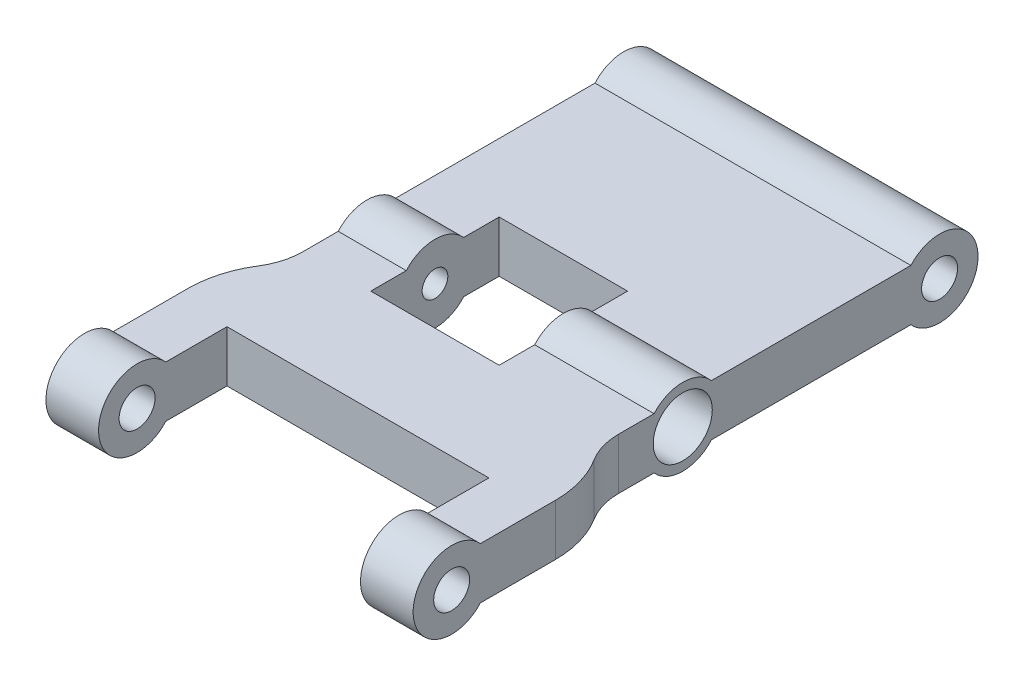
ISO-10303-21;
HEADER;
FILE_DESCRIPTION(('STEP AP214'),'2;1');
FILE_NAME('part.step','',(''),(''),'','','');
FILE_SCHEMA(('AUTOMOTIVE_DESIGN { 1 0 10303 214 1 1 1 1 }'));
ENDSEC;
DATA;
#1=APPLICATION_CONTEXT('core data for automotive mechanical design processes');
#2=APPLICATION_PROTOCOL_DEFINITION('international standard','automotive_design',2000,#1);
#3=PRODUCT_CONTEXT('',#1,'mechanical');
#4=PRODUCT('Part','Part','',(#3));
#5=PRODUCT_RELATED_PRODUCT_CATEGORY('part','',(#4));
#6=PRODUCT_DEFINITION_FORMATION('','',#4);
#7=PRODUCT_DEFINITION_CONTEXT('part definition',#1,'design');
#8=PRODUCT_DEFINITION('design','',#6,#7);
#9=PRODUCT_DEFINITION_SHAPE('','',#8);
#10=(LENGTH_UNIT() NAMED_UNIT(*) SI_UNIT(.MILLI.,.METRE.));
#11=(NAMED_UNIT(*) PLANE_ANGLE_UNIT() SI_UNIT($,.RADIAN.));
#12=(NAMED_UNIT(*) SI_UNIT($,.STERADIAN.) SOLID_ANGLE_UNIT());
#13=UNCERTAINTY_MEASURE_WITH_UNIT(LENGTH_MEASURE(1.E-05),#10,'distance_accuracy_value','');
#14=(GEOMETRIC_REPRESENTATION_CONTEXT(3) GLOBAL_UNCERTAINTY_ASSIGNED_CONTEXT((#13)) GLOBAL_UNIT_ASSIGNED_CONTEXT((#10,
#11,#12)) REPRESENTATION_CONTEXT('',''));
#15=CARTESIAN_POINT('',(0.,0.,0.));
#16=DIRECTION('',(0.,0.,1.));
#17=DIRECTION('',(1.,0.,0.));
#18=AXIS2_PLACEMENT_3D('',#15,#16,#17);
#19=CARTESIAN_POINT('',(0.,2.54,0.));
#20=DIRECTION('',(1.,0.,0.));
#21=DIRECTION('',(0.,0.,-1.));
#22=AXIS2_PLACEMENT_3D('',#19,#20,#21);
#23=CYLINDRICAL_SURFACE('',#22,3.81);
#24=CARTESIAN_POINT('',(28.575,2.54,0.));
#25=DIRECTION('',(1.,0.,0.));
#26=DIRECTION('',(0.,0.,-1.));
#27=AXIS2_PLACEMENT_3D('',#24,#25,#26);
#28=CIRCLE('',#27,3.81);
#29=CARTESIAN_POINT('',(28.575,0.,-2.83980633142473));
#30=VERTEX_POINT('',#29);
#31=CARTESIAN_POINT('',(28.575,5.08,-2.83980633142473));
#32=VERTEX_POINT('',#31);
#33=EDGE_CURVE('E52',#30,#32,#28,.F.);
#34=ORIENTED_EDGE('',*,*,#33,.F.);
#35=DIRECTION('',(1.,0.,0.));
#36=VECTOR('',#35,1.);
#37=CARTESIAN_POINT('',(0.,0.,-2.83980633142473));
#38=LINE('',#37,#36);
#39=CARTESIAN_POINT('',(33.782,0.,-2.83980633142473));
#40=VERTEX_POINT('',#39);
#41=EDGE_CURVE('E230',#40,#30,#38,.F.);
#42=ORIENTED_EDGE('',*,*,#41,.F.);
#43=CARTESIAN_POINT('',(33.782,2.54,0.));
#44=DIRECTION('',(1.,0.,0.));
#45=DIRECTION('',(0.,0.,-1.));
#46=AXIS2_PLACEMENT_3D('',#43,#44,#45);
#47=CIRCLE('',#46,3.81);
#48=CARTESIAN_POINT('',(33.782,5.08,-2.83980633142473));
#49=VERTEX_POINT('',#48);
#50=EDGE_CURVE('E252',#49,#40,#47,.T.);
#51=ORIENTED_EDGE('',*,*,#50,.F.);
#52=DIRECTION('',(1.,0.,0.));
#53=VECTOR('',#52,1.);
#54=CARTESIAN_POINT('',(0.,5.08,-2.83980633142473));
#55=LINE('',#54,#53);
#56=EDGE_CURVE('E374',#32,#49,#55,.T.);
#57=ORIENTED_EDGE('',*,*,#56,.F.);
#58=EDGE_LOOP('',(#34,#42,#51,#57));
#59=FACE_BOUND('',#58,.T.);
#60=ADVANCED_FACE('F35',(#59),#23,.T.);
#61=CARTESIAN_POINT('',(31.242,2.54,-25.4));
#62=DIRECTION('',(-1.,0.,0.));
#63=DIRECTION('',(0.,0.,1.));
#64=AXIS2_PLACEMENT_3D('',#61,#62,#63);
#65=CYLINDRICAL_SURFACE('',#64,1.27);
#66=CARTESIAN_POINT('',(6.731,2.54,-25.4));
#67=DIRECTION('',(-1.,0.,0.));
#68=DIRECTION('',(0.,0.,1.));
#69=AXIS2_PLACEMENT_3D('',#66,#67,#68);
#70=CIRCLE('',#69,1.27);
#71=CARTESIAN_POINT('',(6.731,2.54,-24.13));
#72=VERTEX_POINT('',#71);
#73=EDGE_CURVE('E318',#72,#72,#70,.F.);
#74=CARTESIAN_POINT('',(4.191,2.54,-25.4));
#75=DIRECTION('',(-1.,0.,0.));
#76=DIRECTION('',(0.,0.,1.));
#77=AXIS2_PLACEMENT_3D('',#74,#75,#76);
#78=CIRCLE('',#77,1.27);
#79=CARTESIAN_POINT('',(4.191,2.54,-24.13));
#80=VERTEX_POINT('',#79);
#81=EDGE_CURVE('E281',#80,#80,#78,.F.);
#82=CARTESIAN_POINT('',(6.731,2.54,-24.13));
#83=CARTESIAN_POINT('',(6.70454166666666,2.54,-24.13));
#84=CARTESIAN_POINT('',(6.67808333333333,2.54,-24.13));
#85=CARTESIAN_POINT('',(6.62516666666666,2.54,-24.13));
#86=CARTESIAN_POINT('',(6.59870833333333,2.54,-24.13));
#87=CARTESIAN_POINT('',(6.54579166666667,2.54,-24.13));
#88=CARTESIAN_POINT('',(6.51933333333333,2.54,-24.13));
#89=CARTESIAN_POINT('',(6.46641666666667,2.54,-24.13));
#90=CARTESIAN_POINT('',(6.43995833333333,2.54,-24.13));
#91=CARTESIAN_POINT('',(6.38704166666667,2.54,-24.13));
#92=CARTESIAN_POINT('',(6.36058333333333,2.54,-24.13));
#93=CARTESIAN_POINT('',(6.30766666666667,2.54,-24.13));
#94=CARTESIAN_POINT('',(6.28120833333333,2.54,-24.13));
#95=CARTESIAN_POINT('',(6.22829166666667,2.54,-24.13));
#96=CARTESIAN_POINT('',(6.20183333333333,2.54,-24.13));
#97=CARTESIAN_POINT('',(6.14891666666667,2.54,-24.13));
#98=CARTESIAN_POINT('',(6.12245833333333,2.54,-24.13));
#99=CARTESIAN_POINT('',(6.06954166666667,2.54,-24.13));
#100=CARTESIAN_POINT('',(6.04308333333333,2.54,-24.13));
#101=CARTESIAN_POINT('',(5.99016666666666,2.54,-24.13));
#102=CARTESIAN_POINT('',(5.96370833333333,2.54,-24.13));
#103=CARTESIAN_POINT('',(5.91079166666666,2.54,-24.13));
#104=CARTESIAN_POINT('',(5.88433333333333,2.54,-24.13));
#105=CARTESIAN_POINT('',(5.83141666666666,2.54,-24.13));
#106=CARTESIAN_POINT('',(5.80495833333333,2.54,-24.13));
#107=CARTESIAN_POINT('',(5.75204166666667,2.54,-24.13));
#108=CARTESIAN_POINT('',(5.72558333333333,2.54,-24.13));
#109=CARTESIAN_POINT('',(5.67266666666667,2.54,-24.13));
#110=CARTESIAN_POINT('',(5.64620833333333,2.54,-24.13));
#111=CARTESIAN_POINT('',(5.59329166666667,2.54,-24.13));
#112=CARTESIAN_POINT('',(5.56683333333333,2.54,-24.13));
#113=CARTESIAN_POINT('',(5.51391666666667,2.54,-24.13));
#114=CARTESIAN_POINT('',(5.48745833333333,2.54,-24.13));
#115=CARTESIAN_POINT('',(5.43454166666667,2.54,-24.13));
#116=CARTESIAN_POINT('',(5.40808333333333,2.54,-24.13));
#117=CARTESIAN_POINT('',(5.35516666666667,2.54,-24.13));
#118=CARTESIAN_POINT('',(5.32870833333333,2.54,-24.13));
#119=CARTESIAN_POINT('',(5.27579166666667,2.54,-24.13));
#120=CARTESIAN_POINT('',(5.24933333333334,2.54,-24.13));
#121=CARTESIAN_POINT('',(5.19641666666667,2.54,-24.13));
#122=CARTESIAN_POINT('',(5.16995833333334,2.54,-24.13));
#123=CARTESIAN_POINT('',(5.11704166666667,2.54,-24.13));
#124=CARTESIAN_POINT('',(5.09058333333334,2.54,-24.13));
#125=CARTESIAN_POINT('',(5.03766666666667,2.54,-24.13));
#126=CARTESIAN_POINT('',(5.01120833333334,2.54,-24.13));
#127=CARTESIAN_POINT('',(4.95829166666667,2.54,-24.13));
#128=CARTESIAN_POINT('',(4.93183333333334,2.54,-24.13));
#129=CARTESIAN_POINT('',(4.87891666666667,2.54,-24.13));
#130=CARTESIAN_POINT('',(4.85245833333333,2.54,-24.13));
#131=CARTESIAN_POINT('',(4.79954166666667,2.54,-24.13));
#132=CARTESIAN_POINT('',(4.77308333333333,2.54,-24.13));
#133=CARTESIAN_POINT('',(4.72016666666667,2.54,-24.13));
#134=CARTESIAN_POINT('',(4.69370833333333,2.54,-24.13));
#135=CARTESIAN_POINT('',(4.64079166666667,2.54,-24.13));
#136=CARTESIAN_POINT('',(4.61433333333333,2.54,-24.13));
#137=CARTESIAN_POINT('',(4.56141666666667,2.54,-24.13));
#138=CARTESIAN_POINT('',(4.53495833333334,2.54,-24.13));
#139=CARTESIAN_POINT('',(4.48204166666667,2.54,-24.13));
#140=CARTESIAN_POINT('',(4.45558333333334,2.54,-24.13));
#141=CARTESIAN_POINT('',(4.40266666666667,2.54,-24.13));
#142=CARTESIAN_POINT('',(4.37620833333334,2.54,-24.13));
#143=CARTESIAN_POINT('',(4.32329166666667,2.54,-24.13));
#144=CARTESIAN_POINT('',(4.29683333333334,2.54,-24.13));
#145=CARTESIAN_POINT('',(4.24391666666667,2.54,-24.13));
#146=CARTESIAN_POINT('',(4.21745833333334,2.54,-24.13));
#147=CARTESIAN_POINT('',(4.191,2.54,-24.13));
#148=B_SPLINE_CURVE_WITH_KNOTS('',3,(#82,#83,#84,#85,#86,#87,#88,#89,#90,#91,#92,#93,#94,#95,
#96,#97,#98,#99,#100,#101,#102,#103,#104,#105,#106,#107,#108,#109,#110,#111,#112,#113,#114,#115,
#116,#117,#118,#119,#120,#121,#122,#123,#124,#125,#126,#127,#128,#129,#130,#131,#132,#133,#134,
#135,#136,#137,#138,#139,#140,#141,#142,#143,#144,#145,#146,#147),.UNSPECIFIED.,.F.,.F.,(4,2,2,
2,2,2,2,2,2,2,2,2,2,2,2,2,2,2,2,2,2,2,2,2,2,2,2,2,2,2,2,2,4),(0.,0.0793749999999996,
0.158749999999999,0.238124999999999,0.317499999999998,0.396874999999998,0.476249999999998,
0.555624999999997,0.634999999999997,0.714375,0.793749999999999,0.873124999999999,
0.952499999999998,1.031875,1.11125,1.190625,1.27,1.349375,1.42875,1.508125,1.5875,
1.66687499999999,1.74624999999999,1.82562499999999,1.905,1.984375,2.06375,2.143125,2.2225,
2.301875,2.38124999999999,2.46062499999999,2.53999999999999),.UNSPECIFIED.);
#149=EDGE_CURVE('BSEAM517',#72,#80,#148,.T.);
#150=ORIENTED_EDGE('',*,*,#73,.T.);
#151=ORIENTED_EDGE('',*,*,#81,.F.);
#152=ORIENTED_EDGE('',*,*,#149,.T.);
#153=ORIENTED_EDGE('',*,*,#149,.F.);
#154=EDGE_LOOP('',(#150,#152,#151,#153));
#155=FACE_BOUND('',#154,.T.);
#156=ADVANCED_FACE('F517',(#155),#65,.F.);
#157=CARTESIAN_POINT('',(19.431,2.54,-25.4));
#158=DIRECTION('',(1.,0.,0.));
#159=DIRECTION('',(0.,0.,-1.));
#160=AXIS2_PLACEMENT_3D('',#157,#158,#159);
#161=CIRCLE('',#160,1.27);
#162=CARTESIAN_POINT('',(19.431,2.54,-24.13));
#163=VERTEX_POINT('',#162);
#164=EDGE_CURVE('E292',#163,#163,#161,.F.);
#165=CARTESIAN_POINT('',(21.971,2.54,-25.4));
#166=DIRECTION('',(1.,0.,0.));
#167=DIRECTION('',(0.,0.,-1.));
#168=AXIS2_PLACEMENT_3D('',#165,#166,#167);
#169=CIRCLE('',#168,1.27);
#170=CARTESIAN_POINT('',(21.971,2.54,-24.13));
#171=VERTEX_POINT('',#170);
#172=EDGE_CURVE('E288',#171,#171,#169,.F.);
#173=CARTESIAN_POINT('',(19.431,2.54,-24.13));
#174=CARTESIAN_POINT('',(19.4574583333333,2.54,-24.13));
#175=CARTESIAN_POINT('',(19.4839166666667,2.54,-24.13));
#176=CARTESIAN_POINT('',(19.5368333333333,2.54,-24.13));
#177=CARTESIAN_POINT('',(19.5632916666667,2.54,-24.13));
#178=CARTESIAN_POINT('',(19.6162083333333,2.54,-24.13));
#179=CARTESIAN_POINT('',(19.6426666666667,2.54,-24.13));
#180=CARTESIAN_POINT('',(19.6955833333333,2.54,-24.13));
#181=CARTESIAN_POINT('',(19.7220416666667,2.54,-24.13));
#182=CARTESIAN_POINT('',(19.7749583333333,2.54,-24.13));
#183=CARTESIAN_POINT('',(19.8014166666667,2.54,-24.13));
#184=CARTESIAN_POINT('',(19.8543333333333,2.54,-24.13));
#185=CARTESIAN_POINT('',(19.8807916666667,2.54,-24.13));
#186=CARTESIAN_POINT('',(19.9337083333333,2.54,-24.13));
#187=CARTESIAN_POINT('',(19.9601666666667,2.54,-24.13));
#188=CARTESIAN_POINT('',(20.0130833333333,2.54,-24.13));
#189=CARTESIAN_POINT('',(20.0395416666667,2.54,-24.13));
#190=CARTESIAN_POINT('',(20.0924583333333,2.54,-24.13));
#191=CARTESIAN_POINT('',(20.1189166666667,2.54,-24.13));
#192=CARTESIAN_POINT('',(20.1718333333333,2.54,-24.13));
#193=CARTESIAN_POINT('',(20.1982916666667,2.54,-24.13));
#194=CARTESIAN_POINT('',(20.2512083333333,2.54,-24.13));
#195=CARTESIAN_POINT('',(20.2776666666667,2.54,-24.13));
#196=CARTESIAN_POINT('',(20.3305833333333,2.54,-24.13));
#197=CARTESIAN_POINT('',(20.3570416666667,2.54,-24.13));
#198=CARTESIAN_POINT('',(20.4099583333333,2.54,-24.13));
#199=CARTESIAN_POINT('',(20.4364166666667,2.54,-24.13));
#200=CARTESIAN_POINT('',(20.4893333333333,2.54,-24.13));
#201=CARTESIAN_POINT('',(20.5157916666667,2.54,-24.13));
#202=CARTESIAN_POINT('',(20.5687083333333,2.54,-24.13));
#203=CARTESIAN_POINT('',(20.5951666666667,2.54,-24.13));
#204=CARTESIAN_POINT('',(20.6480833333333,2.54,-24.13));
#205=CARTESIAN_POINT('',(20.6745416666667,2.54,-24.13));
#206=CARTESIAN_POINT('',(20.7274583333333,2.54,-24.13));
#207=CARTESIAN_POINT('',(20.7539166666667,2.54,-24.13));
#208=CARTESIAN_POINT('',(20.8068333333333,2.54,-24.13));
#209=CARTESIAN_POINT('',(20.8332916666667,2.54,-24.13));
#210=CARTESIAN_POINT('',(20.8862083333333,2.54,-24.13));
#211=CARTESIAN_POINT('',(20.9126666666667,2.54,-24.13));
#212=CARTESIAN_POINT('',(20.9655833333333,2.54,-24.13));
#213=CARTESIAN_POINT('',(20.9920416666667,2.54,-24.13));
#214=CARTESIAN_POINT('',(21.0449583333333,2.54,-24.13));
#215=CARTESIAN_POINT('',(21.0714166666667,2.54,-24.13));
#216=CARTESIAN_POINT('',(21.1243333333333,2.54,-24.13));
#217=CARTESIAN_POINT('',(21.1507916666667,2.54,-24.13));
#218=CARTESIAN_POINT('',(21.2037083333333,2.54,-24.13));
#219=CARTESIAN_POINT('',(21.2301666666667,2.54,-24.13));
#220=CARTESIAN_POINT('',(21.2830833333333,2.54,-24.13));
#221=CARTESIAN_POINT('',(21.3095416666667,2.54,-24.13));
#222=CARTESIAN_POINT('',(21.3624583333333,2.54,-24.13));
#223=CARTESIAN_POINT('',(21.3889166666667,2.54,-24.13));
#224=CARTESIAN_POINT('',(21.4418333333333,2.54,-24.13));
#225=CARTESIAN_POINT('',(21.4682916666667,2.54,-24.13));
#226=CARTESIAN_POINT('',(21.5212083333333,2.54,-24.13));
#227=CARTESIAN_POINT('',(21.5476666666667,2.54,-24.13));
#228=CARTESIAN_POINT('',(21.6005833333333,2.54,-24.13));
#229=CARTESIAN_POINT('',(21.6270416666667,2.54,-24.13));
#230=CARTESIAN_POINT('',(21.6799583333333,2.54,-24.13));
#231=CARTESIAN_POINT('',(21.7064166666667,2.54,-24.13));
#232=CARTESIAN_POINT('',(21.7593333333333,2.54,-24.13));
#233=CARTESIAN_POINT('',(21.7857916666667,2.54,-24.13));
#234=CARTESIAN_POINT('',(21.8387083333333,2.54,-24.13));
#235=CARTESIAN_POINT('',(21.8651666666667,2.54,-24.13));
#236=CARTESIAN_POINT('',(21.9180833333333,2.54,-24.13));
#237=CARTESIAN_POINT('',(21.9445416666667,2.54,-24.13));
#238=CARTESIAN_POINT('',(21.971,2.54,-24.13));
#239=B_SPLINE_CURVE_WITH_KNOTS('',3,(#173,#174,#175,#176,#177,#178,#179,#180,#181,#182,#183,
#184,#185,#186,#187,#188,#189,#190,#191,#192,#193,#194,#195,#196,#197,#198,#199,#200,#201,#202,
#203,#204,#205,#206,#207,#208,#209,#210,#211,#212,#213,#214,#215,#216,#217,#218,#219,#220,#221,
#222,#223,#224,#225,#226,#227,#228,#229,#230,#231,#232,#233,#234,#235,#236,#237,#238),
.UNSPECIFIED.,.F.,.F.,(4,2,2,2,2,2,2,2,2,2,2,2,2,2,2,2,2,2,2,2,2,2,2,2,2,2,2,2,2,2,2,2,4),(0.,
0.0793749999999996,0.158749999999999,0.238124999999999,0.317499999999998,0.396874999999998,
0.476249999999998,0.555624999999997,0.634999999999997,0.714374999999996,0.793749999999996,
0.873124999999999,0.952499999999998,1.031875,1.11125,1.190625,1.27,1.349375,1.42875,1.508125,
1.5875,1.666875,1.74625,1.825625,1.905,1.984375,2.06375,2.143125,2.2225,2.301875,2.38125,
2.460625,2.54),.UNSPECIFIED.);
#240=EDGE_CURVE('BSEAM522',#163,#171,#239,.T.);
#241=ORIENTED_EDGE('',*,*,#164,.T.);
#242=ORIENTED_EDGE('',*,*,#172,.F.);
#243=ORIENTED_EDGE('',*,*,#240,.T.);
#244=ORIENTED_EDGE('',*,*,#240,.F.);
#245=EDGE_LOOP('',(#241,#243,#242,#244));
#246=FACE_BOUND('',#245,.T.);
#247=ADVANCED_FACE('F522',(#246),#65,.F.);
#248=CARTESIAN_POINT('',(42.018307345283,2.54,-25.4));
#249=DIRECTION('',(-1.,0.,0.));
#250=DIRECTION('',(0.,0.,1.));
#251=AXIS2_PLACEMENT_3D('',#248,#249,#250);
#252=CYLINDRICAL_SURFACE('',#251,3.81);
#253=CARTESIAN_POINT('',(19.431,2.54,-25.4));
#254=DIRECTION('',(1.,0.,0.));
#255=DIRECTION('',(0.,0.,-1.));
#256=AXIS2_PLACEMENT_3D('',#253,#254,#255);
#257=CIRCLE('',#256,3.81);
#258=CARTESIAN_POINT('',(19.431,5.08,-22.5601936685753));
#259=VERTEX_POINT('',#258);
#260=CARTESIAN_POINT('',(19.431,5.08,-28.2398063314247));
#261=VERTEX_POINT('',#260);
#262=EDGE_CURVE('E310',#259,#261,#257,.F.);
#263=ORIENTED_EDGE('',*,*,#262,.F.);
#264=DIRECTION('',(-1.,0.,0.));
#265=VECTOR('',#264,1.);
#266=CARTESIAN_POINT('',(42.018307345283,5.08,-22.5601936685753));
#267=LINE('',#266,#265);
#268=CARTESIAN_POINT('',(31.242,5.08,-22.5601936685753));
#269=VERTEX_POINT('',#268);
#270=EDGE_CURVE('E353',#269,#259,#267,.T.);
#271=ORIENTED_EDGE('',*,*,#270,.F.);
#272=CARTESIAN_POINT('',(31.242,2.54,-25.4));
#273=DIRECTION('',(-1.,0.,0.));
#274=DIRECTION('',(0.,0.,1.));
#275=AXIS2_PLACEMENT_3D('',#272,#273,#274);
#276=CIRCLE('',#275,3.81);
#277=CARTESIAN_POINT('',(31.242,5.08,-28.2398063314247));
#278=VERTEX_POINT('',#277);
#279=EDGE_CURVE('E345',#278,#269,#276,.F.);
#280=ORIENTED_EDGE('',*,*,#279,.F.);
#281=DIRECTION('',(-1.,0.,0.));
#282=VECTOR('',#281,1.);
#283=CARTESIAN_POINT('',(42.018307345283,5.08,-28.2398063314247));
#284=LINE('',#283,#282);
#285=EDGE_CURVE('E348',#261,#278,#284,.F.);
#286=ORIENTED_EDGE('',*,*,#285,.F.);
#287=EDGE_LOOP('',(#263,#271,#280,#286));
#288=FACE_BOUND('',#287,.T.);
#289=ADVANCED_FACE('F538',(#288),#252,.T.);
#290=DIRECTION('',(-1.,0.,0.));
#291=VECTOR('',#290,1.);
#292=CARTESIAN_POINT('',(42.018307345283,0.,-22.5601936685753));
#293=LINE('',#292,#291);
#294=CARTESIAN_POINT('',(19.431,0.,-22.5601936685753));
#295=VERTEX_POINT('',#294);
#296=CARTESIAN_POINT('',(31.242,0.,-22.5601936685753));
#297=VERTEX_POINT('',#296);
#298=EDGE_CURVE('E356',#295,#297,#293,.F.);
#299=ORIENTED_EDGE('',*,*,#298,.F.);
#300=CARTESIAN_POINT('',(19.431,2.54,-25.4));
#301=DIRECTION('',(1.,0.,0.));
#302=DIRECTION('',(0.,0.,-1.));
#303=AXIS2_PLACEMENT_3D('',#300,#301,#302);
#304=CIRCLE('',#303,3.81);
#305=CARTESIAN_POINT('',(19.431,0.,-28.2398063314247));
#306=VERTEX_POINT('',#305);
#307=EDGE_CURVE('E302',#306,#295,#304,.F.);
#308=ORIENTED_EDGE('',*,*,#307,.F.);
#309=DIRECTION('',(-1.,0.,0.));
#310=VECTOR('',#309,1.);
#311=CARTESIAN_POINT('',(42.018307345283,0.,-28.2398063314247));
#312=LINE('',#311,#310);
#313=CARTESIAN_POINT('',(31.242,0.,-28.2398063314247));
#314=VERTEX_POINT('',#313);
#315=EDGE_CURVE('E361',#314,#306,#312,.T.);
#316=ORIENTED_EDGE('',*,*,#315,.F.);
#317=EDGE_CURVE('E346',#297,#314,#276,.F.);
#318=ORIENTED_EDGE('',*,*,#317,.F.);
#319=EDGE_LOOP('',(#299,#308,#316,#318));
#320=FACE_BOUND('',#319,.T.);
#321=ADVANCED_FACE('F535',(#320),#252,.T.);
#322=CARTESIAN_POINT('',(31.242,0.,0.));
#323=DIRECTION('',(0.,1.,0.));
#324=DIRECTION('',(0.,0.,1.));
#325=AXIS2_PLACEMENT_3D('',#322,#323,#324);
#326=PLANE('',#325);
#327=DIRECTION('',(-1.,0.,0.));
#328=VECTOR('',#327,1.);
#329=CARTESIAN_POINT('',(31.242,0.,-31.75));
#330=LINE('',#329,#328);
#331=CARTESIAN_POINT('',(19.431,0.,-31.75));
#332=VERTEX_POINT('',#331);
#333=CARTESIAN_POINT('',(6.731,0.,-31.75));
#334=VERTEX_POINT('',#333);
#335=EDGE_CURVE('E335',#332,#334,#330,.T.);
#336=ORIENTED_EDGE('',*,*,#335,.T.);
#337=DIRECTION('',(0.,0.,1.));
#338=VECTOR('',#337,1.);
#339=CARTESIAN_POINT('',(6.731,0.,0.));
#340=LINE('',#339,#338);
#341=CARTESIAN_POINT('',(6.73099999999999,0.,-28.2398063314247));
#342=VERTEX_POINT('',#341);
#343=EDGE_CURVE('E324',#334,#342,#340,.T.);
#344=ORIENTED_EDGE('',*,*,#343,.T.);
#345=CARTESIAN_POINT('',(0.,0.,-28.2398063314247));
#346=VERTEX_POINT('',#345);
#347=EDGE_CURVE('E360',#342,#346,#312,.T.);
#348=ORIENTED_EDGE('',*,*,#347,.T.);
#349=DIRECTION('',(0.,0.,-1.));
#350=VECTOR('',#349,1.);
#351=CARTESIAN_POINT('',(0.,0.,0.));
#352=LINE('',#351,#350);
#353=CARTESIAN_POINT('',(0.,0.,-47.9601936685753));
#354=VERTEX_POINT('',#353);
#355=EDGE_CURVE('E380',#346,#354,#352,.T.);
#356=ORIENTED_EDGE('',*,*,#355,.T.);
#357=DIRECTION('',(1.,0.,0.));
#358=VECTOR('',#357,1.);
#359=CARTESIAN_POINT('',(0.,0.,-47.9601936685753));
#360=LINE('',#359,#358);
#361=CARTESIAN_POINT('',(31.242,0.,-47.9601936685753));
#362=VERTEX_POINT('',#361);
#363=EDGE_CURVE('E371',#354,#362,#360,.T.);
#364=ORIENTED_EDGE('',*,*,#363,.T.);
#365=DIRECTION('',(0.,0.,-1.));
#366=VECTOR('',#365,1.);
#367=CARTESIAN_POINT('',(31.242,0.,0.));
#368=LINE('',#367,#366);
#369=EDGE_CURVE('E384',#314,#362,#368,.T.);
#370=ORIENTED_EDGE('',*,*,#369,.F.);
#371=ORIENTED_EDGE('',*,*,#315,.T.);
#372=DIRECTION('',(0.,0.,-1.));
#373=VECTOR('',#372,1.);
#374=CARTESIAN_POINT('',(19.431,0.,0.));
#375=LINE('',#374,#373);
#376=EDGE_CURVE('E307',#306,#332,#375,.T.);
#377=ORIENTED_EDGE('',*,*,#376,.T.);
#378=EDGE_LOOP('',(#336,#344,#348,#356,#364,#370,#371,#377));
#379=FACE_BOUND('',#378,.T.);
#380=ADVANCED_FACE('F483',(#379),#326,.F.);
#381=CARTESIAN_POINT('',(31.242,5.08,0.));
#382=DIRECTION('',(0.,-1.,0.));
#383=DIRECTION('',(0.,0.,-1.));
#384=AXIS2_PLACEMENT_3D('',#381,#382,#383);
#385=PLANE('',#384);
#386=CARTESIAN_POINT('',(-2.54,5.08,-2.83980633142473));
#387=VERTEX_POINT('',#386);
#388=CARTESIAN_POINT('',(2.667,5.08,-2.83980633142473));
#389=VERTEX_POINT('',#388);
#390=EDGE_CURVE('E375',#387,#389,#55,.T.);
#391=ORIENTED_EDGE('',*,*,#390,.T.);
#392=DIRECTION('',(0.,0.,-1.));
#393=VECTOR('',#392,1.);
#394=CARTESIAN_POINT('',(2.667,5.08,0.));
#395=LINE('',#394,#393);
#396=CARTESIAN_POINT('',(2.667,5.08,-8.89));
#397=VERTEX_POINT('',#396);
#398=EDGE_CURVE('E237',#389,#397,#395,.T.);
#399=ORIENTED_EDGE('',*,*,#398,.T.);
#400=DIRECTION('',(1.,0.,0.));
#401=VECTOR('',#400,1.);
#402=CARTESIAN_POINT('',(31.242,5.08,-8.89));
#403=LINE('',#402,#401);
#404=CARTESIAN_POINT('',(28.575,5.08,-8.89));
#405=VERTEX_POINT('',#404);
#406=EDGE_CURVE('E240',#397,#405,#403,.T.);
#407=ORIENTED_EDGE('',*,*,#406,.T.);
#408=DIRECTION('',(0.,0.,1.));
#409=VECTOR('',#408,1.);
#410=CARTESIAN_POINT('',(28.575,5.08,0.));
#411=LINE('',#410,#409);
#412=EDGE_CURVE('E225',#405,#32,#411,.T.);
#413=ORIENTED_EDGE('',*,*,#412,.T.);
#414=ORIENTED_EDGE('',*,*,#56,.T.);
#415=DIRECTION('',(0.,0.,1.));
#416=VECTOR('',#415,1.);
#417=CARTESIAN_POINT('',(33.782,5.08,-2.83980633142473));
#418=LINE('',#417,#416);
#419=CARTESIAN_POINT('',(33.782,5.08,-10.2511818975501));
#420=VERTEX_POINT('',#419);
#421=EDGE_CURVE('E258',#420,#49,#418,.T.);
#422=ORIENTED_EDGE('',*,*,#421,.F.);
#423=CARTESIAN_POINT('',(23.622,5.08,-10.2511818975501));
#424=DIRECTION('',(0.,-1.,0.));
#425=DIRECTION('',(0.,0.,-1.));
#426=AXIS2_PLACEMENT_3D('',#423,#424,#425);
#427=CIRCLE('',#426,10.16);
#428=CARTESIAN_POINT('',(32.2189230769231,5.08,-15.6658391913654));
#429=VERTEX_POINT('',#428);
#430=EDGE_CURVE('E418',#420,#429,#427,.F.);
#431=ORIENTED_EDGE('',*,*,#430,.T.);
#432=CARTESIAN_POINT('',(37.592,5.08,-19.05));
#433=DIRECTION('',(0.,1.,0.));
#434=DIRECTION('',(0.,0.,1.));
#435=AXIS2_PLACEMENT_3D('',#432,#433,#434);
#436=CIRCLE('',#435,6.35);
#437=CARTESIAN_POINT('',(31.242,5.08,-19.05));
#438=VERTEX_POINT('',#437);
#439=EDGE_CURVE('E242',#438,#429,#436,.T.);
#440=ORIENTED_EDGE('',*,*,#439,.F.);
#441=DIRECTION('',(0.,0.,1.));
#442=VECTOR('',#441,1.);
#443=CARTESIAN_POINT('',(31.242,5.08,0.));
#444=LINE('',#443,#442);
#445=EDGE_CURVE('E383',#269,#438,#444,.T.);
#446=ORIENTED_EDGE('',*,*,#445,.F.);
#447=ORIENTED_EDGE('',*,*,#270,.T.);
#448=DIRECTION('',(0.,0.,1.));
#449=VECTOR('',#448,1.);
#450=CARTESIAN_POINT('',(19.431,5.08,0.));
#451=LINE('',#450,#449);
#452=CARTESIAN_POINT('',(19.431,5.08,-19.05));
#453=VERTEX_POINT('',#452);
#454=EDGE_CURVE('E315',#259,#453,#451,.T.);
#455=ORIENTED_EDGE('',*,*,#454,.T.);
#456=DIRECTION('',(-1.,0.,0.));
#457=VECTOR('',#456,1.);
#458=CARTESIAN_POINT('',(31.242,5.08,-19.05));
#459=LINE('',#458,#457);
#460=CARTESIAN_POINT('',(6.731,5.08,-19.05));
#461=VERTEX_POINT('',#460);
#462=EDGE_CURVE('E338',#453,#461,#459,.T.);
#463=ORIENTED_EDGE('',*,*,#462,.T.);
#464=DIRECTION('',(0.,0.,-1.));
#465=VECTOR('',#464,1.);
#466=CARTESIAN_POINT('',(6.731,5.08,0.));
#467=LINE('',#466,#465);
#468=CARTESIAN_POINT('',(6.73099999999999,5.08,-22.5601936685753));
#469=VERTEX_POINT('',#468);
#470=EDGE_CURVE('E332',#461,#469,#467,.T.);
#471=ORIENTED_EDGE('',*,*,#470,.T.);
#472=CARTESIAN_POINT('',(0.,5.08,-22.5601936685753));
#473=VERTEX_POINT('',#472);
#474=EDGE_CURVE('E352',#469,#473,#267,.T.);
#475=ORIENTED_EDGE('',*,*,#474,.T.);
#476=DIRECTION('',(0.,0.,1.));
#477=VECTOR('',#476,1.);
#478=CARTESIAN_POINT('',(0.,5.08,0.));
#479=LINE('',#478,#477);
#480=CARTESIAN_POINT('',(0.,5.08,-19.05));
#481=VERTEX_POINT('',#480);
#482=EDGE_CURVE('E391',#473,#481,#479,.T.);
#483=ORIENTED_EDGE('',*,*,#482,.T.);
#484=CARTESIAN_POINT('',(-6.35,5.08,-19.05));
#485=DIRECTION('',(0.,1.,0.));
#486=DIRECTION('',(0.,0.,-1.));
#487=AXIS2_PLACEMENT_3D('',#484,#485,#486);
#488=CIRCLE('',#487,6.35);
#489=CARTESIAN_POINT('',(-0.976923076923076,5.08,-15.6658391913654));
#490=VERTEX_POINT('',#489);
#491=EDGE_CURVE('E243',#490,#481,#488,.T.);
#492=ORIENTED_EDGE('',*,*,#491,.F.);
#493=CARTESIAN_POINT('',(7.62,5.08,-10.2511818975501));
#494=DIRECTION('',(0.,-1.,0.));
#495=DIRECTION('',(0.,0.,-1.));
#496=AXIS2_PLACEMENT_3D('',#493,#494,#495);
#497=CIRCLE('',#496,10.16);
#498=CARTESIAN_POINT('',(-2.54,5.08,-10.2511818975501));
#499=VERTEX_POINT('',#498);
#500=EDGE_CURVE('E60',#490,#499,#497,.F.);
#501=ORIENTED_EDGE('',*,*,#500,.T.);
#502=DIRECTION('',(0.,0.,1.));
#503=VECTOR('',#502,1.);
#504=CARTESIAN_POINT('',(-2.54,5.08,-2.83980633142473));
#505=LINE('',#504,#503);
#506=EDGE_CURVE('E267',#499,#387,#505,.T.);
#507=ORIENTED_EDGE('',*,*,#506,.T.);
#508=EDGE_LOOP('',(#391,#399,#407,#413,#414,#422,#431,#440,#446,#447,#455,#463,#471,#475,#483,
#492,#501,#507));
#509=FACE_BOUND('',#508,.T.);
#510=ADVANCED_FACE('F465',(#509),#385,.F.);
#511=DIRECTION('',(-1.,0.,0.));
#512=VECTOR('',#511,1.);
#513=CARTESIAN_POINT('',(31.242,0.,-8.89));
#514=LINE('',#513,#512);
#515=CARTESIAN_POINT('',(28.575,0.,-8.89));
#516=VERTEX_POINT('',#515);
#517=CARTESIAN_POINT('',(2.667,0.,-8.89));
#518=VERTEX_POINT('',#517);
#519=EDGE_CURVE('E12',#516,#518,#514,.T.);
#520=ORIENTED_EDGE('',*,*,#519,.T.);
#521=DIRECTION('',(0.,0.,1.));
#522=VECTOR('',#521,1.);
#523=CARTESIAN_POINT('',(2.667,0.,0.));
#524=LINE('',#523,#522);
#525=CARTESIAN_POINT('',(2.667,0.,-2.83980633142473));
#526=VERTEX_POINT('',#525);
#527=EDGE_CURVE('E232',#518,#526,#524,.T.);
#528=ORIENTED_EDGE('',*,*,#527,.T.);
#529=CARTESIAN_POINT('',(-2.54,0.,-2.83980633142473));
#530=VERTEX_POINT('',#529);
#531=EDGE_CURVE('E378',#526,#530,#38,.F.);
#532=ORIENTED_EDGE('',*,*,#531,.T.);
#533=DIRECTION('',(0.,0.,-1.));
#534=VECTOR('',#533,1.);
#535=CARTESIAN_POINT('',(-2.54,0.,-2.83980633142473));
#536=LINE('',#535,#534);
#537=CARTESIAN_POINT('',(-2.54,0.,-10.2511818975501));
#538=VERTEX_POINT('',#537);
#539=EDGE_CURVE('E264',#530,#538,#536,.T.);
#540=ORIENTED_EDGE('',*,*,#539,.T.);
#541=CARTESIAN_POINT('',(7.62,0.,-10.2511818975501));
#542=DIRECTION('',(0.,1.,0.));
#543=DIRECTION('',(0.,0.,1.));
#544=AXIS2_PLACEMENT_3D('',#541,#542,#543);
#545=CIRCLE('',#544,10.16);
#546=CARTESIAN_POINT('',(-0.976923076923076,0.,-15.6658391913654));
#547=VERTEX_POINT('',#546);
#548=EDGE_CURVE('E411',#538,#547,#545,.F.);
#549=ORIENTED_EDGE('',*,*,#548,.T.);
#550=CARTESIAN_POINT('',(-6.35,0.,-19.05));
#551=DIRECTION('',(0.,1.,0.));
#552=DIRECTION('',(0.,0.,1.));
#553=AXIS2_PLACEMENT_3D('',#550,#551,#552);
#554=CIRCLE('',#553,6.35);
#555=CARTESIAN_POINT('',(0.,0.,-19.05));
#556=VERTEX_POINT('',#555);
#557=EDGE_CURVE('E250',#547,#556,#554,.T.);
#558=ORIENTED_EDGE('',*,*,#557,.T.);
#559=CARTESIAN_POINT('',(0.,0.,-22.5601936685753));
#560=VERTEX_POINT('',#559);
#561=EDGE_CURVE('E389',#556,#560,#352,.T.);
#562=ORIENTED_EDGE('',*,*,#561,.T.);
#563=CARTESIAN_POINT('',(6.73099999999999,0.,-22.5601936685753));
#564=VERTEX_POINT('',#563);
#565=EDGE_CURVE('E357',#560,#564,#293,.F.);
#566=ORIENTED_EDGE('',*,*,#565,.T.);
#567=DIRECTION('',(0.,0.,1.));
#568=VECTOR('',#567,1.);
#569=CARTESIAN_POINT('',(6.731,0.,0.));
#570=LINE('',#569,#568);
#571=CARTESIAN_POINT('',(6.731,0.,-19.05));
#572=VERTEX_POINT('',#571);
#573=EDGE_CURVE('E321',#564,#572,#570,.T.);
#574=ORIENTED_EDGE('',*,*,#573,.T.);
#575=DIRECTION('',(1.,0.,0.));
#576=VECTOR('',#575,1.);
#577=CARTESIAN_POINT('',(31.242,0.,-19.05));
#578=LINE('',#577,#576);
#579=CARTESIAN_POINT('',(19.431,0.,-19.05));
#580=VERTEX_POINT('',#579);
#581=EDGE_CURVE('E401',#572,#580,#578,.T.);
#582=ORIENTED_EDGE('',*,*,#581,.T.);
#583=DIRECTION('',(0.,0.,-1.));
#584=VECTOR('',#583,1.);
#585=CARTESIAN_POINT('',(19.431,0.,0.));
#586=LINE('',#585,#584);
#587=EDGE_CURVE('E304',#580,#295,#586,.T.);
#588=ORIENTED_EDGE('',*,*,#587,.T.);
#589=ORIENTED_EDGE('',*,*,#298,.T.);
#590=CARTESIAN_POINT('',(31.242,0.,-19.05));
#591=VERTEX_POINT('',#590);
#592=EDGE_CURVE('E381',#591,#297,#368,.T.);
#593=ORIENTED_EDGE('',*,*,#592,.F.);
#594=CARTESIAN_POINT('',(37.592,0.,-19.05));
#595=DIRECTION('',(0.,1.,0.));
#596=DIRECTION('',(0.,0.,1.));
#597=AXIS2_PLACEMENT_3D('',#594,#595,#596);
#598=CIRCLE('',#597,6.35);
#599=CARTESIAN_POINT('',(32.2189230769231,0.,-15.6658391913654));
#600=VERTEX_POINT('',#599);
#601=EDGE_CURVE('E245',#591,#600,#598,.T.);
#602=ORIENTED_EDGE('',*,*,#601,.T.);
#603=CARTESIAN_POINT('',(23.622,0.,-10.2511818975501));
#604=DIRECTION('',(0.,1.,0.));
#605=DIRECTION('',(0.,0.,1.));
#606=AXIS2_PLACEMENT_3D('',#603,#604,#605);
#607=CIRCLE('',#606,10.16);
#608=CARTESIAN_POINT('',(33.782,0.,-10.2511818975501));
#609=VERTEX_POINT('',#608);
#610=EDGE_CURVE('E413',#600,#609,#607,.F.);
#611=ORIENTED_EDGE('',*,*,#610,.T.);
#612=DIRECTION('',(0.,0.,-1.));
#613=VECTOR('',#612,1.);
#614=CARTESIAN_POINT('',(33.782,0.,-2.83980633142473));
#615=LINE('',#614,#613);
#616=EDGE_CURVE('E255',#40,#609,#615,.T.);
#617=ORIENTED_EDGE('',*,*,#616,.F.);
#618=ORIENTED_EDGE('',*,*,#41,.T.);
#619=DIRECTION('',(0.,0.,-1.));
#620=VECTOR('',#619,1.);
#621=CARTESIAN_POINT('',(28.575,0.,0.));
#622=LINE('',#621,#620);
#623=EDGE_CURVE('E222',#30,#516,#622,.T.);
#624=ORIENTED_EDGE('',*,*,#623,.T.);
#625=EDGE_LOOP('',(#520,#528,#532,#540,#549,#558,#562,#566,#574,#582,#588,#589,#593,#602,#611,
#617,#618,#624));
#626=FACE_BOUND('',#625,.T.);
#627=ADVANCED_FACE('F228',(#626),#326,.F.);
#628=CARTESIAN_POINT('',(0.,5.08,-28.2398063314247));
#629=VERTEX_POINT('',#628);
#630=CARTESIAN_POINT('',(6.73099999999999,5.08,-28.2398063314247));
#631=VERTEX_POINT('',#630);
#632=EDGE_CURVE('E349',#629,#631,#284,.F.);
#633=ORIENTED_EDGE('',*,*,#632,.T.);
#634=DIRECTION('',(0.,0.,-1.));
#635=VECTOR('',#634,1.);
#636=CARTESIAN_POINT('',(6.731,5.08,0.));
#637=LINE('',#636,#635);
#638=CARTESIAN_POINT('',(6.731,5.08,-31.75));
#639=VERTEX_POINT('',#638);
#640=EDGE_CURVE('E329',#631,#639,#637,.T.);
#641=ORIENTED_EDGE('',*,*,#640,.T.);
#642=DIRECTION('',(1.,0.,0.));
#643=VECTOR('',#642,1.);
#644=CARTESIAN_POINT('',(31.242,5.08,-31.75));
#645=LINE('',#644,#643);
#646=CARTESIAN_POINT('',(19.431,5.08,-31.75));
#647=VERTEX_POINT('',#646);
#648=EDGE_CURVE('E388',#639,#647,#645,.T.);
#649=ORIENTED_EDGE('',*,*,#648,.T.);
#650=DIRECTION('',(0.,0.,1.));
#651=VECTOR('',#650,1.);
#652=CARTESIAN_POINT('',(19.431,5.08,0.));
#653=LINE('',#652,#651);
#654=EDGE_CURVE('E312',#647,#261,#653,.T.);
#655=ORIENTED_EDGE('',*,*,#654,.T.);
#656=ORIENTED_EDGE('',*,*,#285,.T.);
#657=CARTESIAN_POINT('',(31.242,5.08,-47.9601936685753));
#658=VERTEX_POINT('',#657);
#659=EDGE_CURVE('E385',#658,#278,#444,.T.);
#660=ORIENTED_EDGE('',*,*,#659,.F.);
#661=DIRECTION('',(1.,0.,0.));
#662=VECTOR('',#661,1.);
#663=CARTESIAN_POINT('',(0.,5.08,-47.9601936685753));
#664=LINE('',#663,#662);
#665=CARTESIAN_POINT('',(0.,5.08,-47.9601936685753));
#666=VERTEX_POINT('',#665);
#667=EDGE_CURVE('E367',#658,#666,#664,.F.);
#668=ORIENTED_EDGE('',*,*,#667,.T.);
#669=EDGE_CURVE('E392',#666,#629,#479,.T.);
#670=ORIENTED_EDGE('',*,*,#669,.T.);
#671=EDGE_LOOP('',(#633,#641,#649,#655,#656,#660,#668,#670));
#672=FACE_BOUND('',#671,.T.);
#673=ADVANCED_FACE('F471',(#672),#385,.F.);
#674=CARTESIAN_POINT('',(31.242,0.,0.));
#675=DIRECTION('',(-1.,0.,0.));
#676=DIRECTION('',(0.,0.,1.));
#677=AXIS2_PLACEMENT_3D('',#674,#675,#676);
#678=PLANE('',#677);
#679=CARTESIAN_POINT('',(31.242,2.54,-50.8));
#680=DIRECTION('',(-1.,0.,0.));
#681=DIRECTION('',(0.,0.,1.));
#682=AXIS2_PLACEMENT_3D('',#679,#680,#681);
#683=CIRCLE('',#682,1.778);
#684=CARTESIAN_POINT('',(31.242,2.54,-49.022));
#685=VERTEX_POINT('',#684);
#686=EDGE_CURVE('E226',#685,#685,#683,.T.);
#687=ORIENTED_EDGE('',*,*,#686,.T.);
#688=EDGE_LOOP('',(#687));
#689=FACE_BOUND('',#688,.T.);
#690=CARTESIAN_POINT('',(31.242,2.54,-25.4));
#691=DIRECTION('',(1.,0.,0.));
#692=DIRECTION('',(0.,0.,-1.));
#693=AXIS2_PLACEMENT_3D('',#690,#691,#692);
#694=CIRCLE('',#693,2.921);
#695=CARTESIAN_POINT('',(31.242,2.54,-28.321));
#696=VERTEX_POINT('',#695);
#697=EDGE_CURVE('E282',#696,#696,#694,.T.);
#698=ORIENTED_EDGE('',*,*,#697,.F.);
#699=EDGE_LOOP('',(#698));
#700=FACE_BOUND('',#699,.T.);
#701=ORIENTED_EDGE('',*,*,#279,.T.);
#702=ORIENTED_EDGE('',*,*,#445,.T.);
#703=DIRECTION('',(0.,-1.,0.));
#704=VECTOR('',#703,1.);
#705=CARTESIAN_POINT('',(31.242,0.,-19.05));
#706=LINE('',#705,#704);
#707=EDGE_CURVE('E272',#438,#591,#706,.T.);
#708=ORIENTED_EDGE('',*,*,#707,.T.);
#709=ORIENTED_EDGE('',*,*,#592,.T.);
#710=ORIENTED_EDGE('',*,*,#317,.T.);
#711=ORIENTED_EDGE('',*,*,#369,.T.);
#712=CARTESIAN_POINT('',(31.242,2.54,-50.8));
#713=DIRECTION('',(1.,0.,0.));
#714=DIRECTION('',(0.,0.,-1.));
#715=AXIS2_PLACEMENT_3D('',#712,#713,#714);
#716=CIRCLE('',#715,3.81);
#717=EDGE_CURVE('E364',#362,#658,#716,.T.);
#718=ORIENTED_EDGE('',*,*,#717,.T.);
#719=ORIENTED_EDGE('',*,*,#659,.T.);
#720=EDGE_LOOP('',(#701,#702,#708,#709,#710,#711,#718,#719));
#721=FACE_BOUND('',#720,.T.);
#722=ADVANCED_FACE('F455',(#689,#700,#721),#678,.F.);
#723=CARTESIAN_POINT('',(0.,0.,0.));
#724=DIRECTION('',(-1.,0.,0.));
#725=DIRECTION('',(0.,0.,1.));
#726=AXIS2_PLACEMENT_3D('',#723,#724,#725);
#727=PLANE('',#726);
#728=CARTESIAN_POINT('',(0.,2.54,-50.8));
#729=DIRECTION('',(-1.,0.,0.));
#730=DIRECTION('',(0.,0.,1.));
#731=AXIS2_PLACEMENT_3D('',#728,#729,#730);
#732=CIRCLE('',#731,1.778);
#733=CARTESIAN_POINT('',(0.,2.54,-49.022));
#734=VERTEX_POINT('',#733);
#735=EDGE_CURVE('E39',#734,#734,#732,.T.);
#736=ORIENTED_EDGE('',*,*,#735,.F.);
#737=EDGE_LOOP('',(#736));
#738=FACE_BOUND('',#737,.T.);
#739=CARTESIAN_POINT('',(0.,2.54,-25.4));
#740=DIRECTION('',(-1.,0.,0.));
#741=DIRECTION('',(0.,0.,1.));
#742=AXIS2_PLACEMENT_3D('',#739,#740,#741);
#743=CIRCLE('',#742,2.921);
#744=CARTESIAN_POINT('',(0.,2.54,-22.479));
#745=VERTEX_POINT('',#744);
#746=EDGE_CURVE('E275',#745,#745,#743,.T.);
#747=ORIENTED_EDGE('',*,*,#746,.F.);
#748=EDGE_LOOP('',(#747));
#749=FACE_BOUND('',#748,.T.);
#750=ORIENTED_EDGE('',*,*,#482,.F.);
#751=CARTESIAN_POINT('',(0.,2.54,-25.4));
#752=DIRECTION('',(-1.,0.,0.));
#753=DIRECTION('',(0.,0.,1.));
#754=AXIS2_PLACEMENT_3D('',#751,#752,#753);
#755=CIRCLE('',#754,3.81);
#756=EDGE_CURVE('E342',#473,#629,#755,.T.);
#757=ORIENTED_EDGE('',*,*,#756,.T.);
#758=ORIENTED_EDGE('',*,*,#669,.F.);
#759=CARTESIAN_POINT('',(0.,2.54,-50.8));
#760=DIRECTION('',(1.,0.,0.));
#761=DIRECTION('',(0.,0.,-1.));
#762=AXIS2_PLACEMENT_3D('',#759,#760,#761);
#763=CIRCLE('',#762,3.81);
#764=EDGE_CURVE('E365',#354,#666,#763,.T.);
#765=ORIENTED_EDGE('',*,*,#764,.F.);
#766=ORIENTED_EDGE('',*,*,#355,.F.);
#767=EDGE_CURVE('E341',#346,#560,#755,.T.);
#768=ORIENTED_EDGE('',*,*,#767,.T.);
#769=ORIENTED_EDGE('',*,*,#561,.F.);
#770=DIRECTION('',(0.,-1.,0.));
#771=VECTOR('',#770,1.);
#772=CARTESIAN_POINT('',(0.,0.,-19.05));
#773=LINE('',#772,#771);
#774=EDGE_CURVE('E269',#481,#556,#773,.T.);
#775=ORIENTED_EDGE('',*,*,#774,.F.);
#776=EDGE_LOOP('',(#750,#757,#758,#765,#766,#768,#769,#775));
#777=FACE_BOUND('',#776,.T.);
#778=ADVANCED_FACE('F451',(#738,#749,#777),#727,.T.);
#779=CARTESIAN_POINT('',(2.667,2.54,0.));
#780=DIRECTION('',(-1.,0.,0.));
#781=DIRECTION('',(0.,0.,1.));
#782=AXIS2_PLACEMENT_3D('',#779,#780,#781);
#783=CIRCLE('',#782,3.81);
#784=EDGE_CURVE('E44',#389,#526,#783,.F.);
#785=ORIENTED_EDGE('',*,*,#784,.F.);
#786=ORIENTED_EDGE('',*,*,#390,.F.);
#787=CARTESIAN_POINT('',(-2.54,2.54,0.));
#788=DIRECTION('',(1.,0.,0.));
#789=DIRECTION('',(0.,0.,-1.));
#790=AXIS2_PLACEMENT_3D('',#787,#788,#789);
#791=CIRCLE('',#790,3.81);
#792=EDGE_CURVE('E261',#387,#530,#791,.T.);
#793=ORIENTED_EDGE('',*,*,#792,.T.);
#794=ORIENTED_EDGE('',*,*,#531,.F.);
#795=EDGE_LOOP('',(#785,#786,#793,#794));
#796=FACE_BOUND('',#795,.T.);
#797=ADVANCED_FACE('F454',(#796),#23,.T.);
#798=CARTESIAN_POINT('',(0.,2.54,-50.8));
#799=DIRECTION('',(1.,0.,0.));
#800=DIRECTION('',(0.,0.,-1.));
#801=AXIS2_PLACEMENT_3D('',#798,#799,#800);
#802=CYLINDRICAL_SURFACE('',#801,3.81);
#803=ORIENTED_EDGE('',*,*,#363,.F.);
#804=ORIENTED_EDGE('',*,*,#764,.T.);
#805=ORIENTED_EDGE('',*,*,#667,.F.);
#806=ORIENTED_EDGE('',*,*,#717,.F.);
#807=EDGE_LOOP('',(#803,#804,#805,#806));
#808=FACE_BOUND('',#807,.T.);
#809=ADVANCED_FACE('F479',(#808),#802,.T.);
#810=CARTESIAN_POINT('',(6.73099999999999,2.54,-25.4));
#811=DIRECTION('',(-1.,0.,0.));
#812=DIRECTION('',(0.,0.,1.));
#813=AXIS2_PLACEMENT_3D('',#810,#811,#812);
#814=CIRCLE('',#813,3.81);
#815=EDGE_CURVE('E327',#631,#469,#814,.F.);
#816=ORIENTED_EDGE('',*,*,#815,.F.);
#817=ORIENTED_EDGE('',*,*,#632,.F.);
#818=ORIENTED_EDGE('',*,*,#756,.F.);
#819=ORIENTED_EDGE('',*,*,#474,.F.);
#820=EDGE_LOOP('',(#816,#817,#818,#819));
#821=FACE_BOUND('',#820,.T.);
#822=ADVANCED_FACE('F468',(#821),#252,.T.);
#823=CARTESIAN_POINT('',(6.73099999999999,2.54,-25.4));
#824=DIRECTION('',(-1.,0.,0.));
#825=DIRECTION('',(0.,0.,1.));
#826=AXIS2_PLACEMENT_3D('',#823,#824,#825);
#827=CIRCLE('',#826,3.81);
#828=EDGE_CURVE('E319',#564,#342,#827,.F.);
#829=ORIENTED_EDGE('',*,*,#828,.F.);
#830=ORIENTED_EDGE('',*,*,#565,.F.);
#831=ORIENTED_EDGE('',*,*,#767,.F.);
#832=ORIENTED_EDGE('',*,*,#347,.F.);
#833=EDGE_LOOP('',(#829,#830,#831,#832));
#834=FACE_BOUND('',#833,.T.);
#835=ADVANCED_FACE('F488',(#834),#252,.T.);
#836=CARTESIAN_POINT('',(6.731,-1.27,-19.05));
#837=DIRECTION('',(0.,0.,1.));
#838=DIRECTION('',(1.,0.,0.));
#839=AXIS2_PLACEMENT_3D('',#836,#837,#838);
#840=PLANE('',#839);
#841=DIRECTION('',(0.,1.,0.));
#842=VECTOR('',#841,1.);
#843=CARTESIAN_POINT('',(19.431,-1.27,-19.05));
#844=LINE('',#843,#842);
#845=EDGE_CURVE('E296',#580,#453,#844,.T.);
#846=ORIENTED_EDGE('',*,*,#845,.F.);
#847=ORIENTED_EDGE('',*,*,#581,.F.);
#848=DIRECTION('',(0.,1.,0.));
#849=VECTOR('',#848,1.);
#850=CARTESIAN_POINT('',(6.731,-1.27,-19.05));
#851=LINE('',#850,#849);
#852=EDGE_CURVE('E299',#572,#461,#851,.T.);
#853=ORIENTED_EDGE('',*,*,#852,.T.);
#854=ORIENTED_EDGE('',*,*,#462,.F.);
#855=EDGE_LOOP('',(#846,#847,#853,#854));
#856=FACE_BOUND('',#855,.T.);
#857=ADVANCED_FACE('F537',(#856),#840,.F.);
#858=CARTESIAN_POINT('',(6.731,-1.27,-31.75));
#859=DIRECTION('',(0.,0.,-1.));
#860=DIRECTION('',(-1.,0.,0.));
#861=AXIS2_PLACEMENT_3D('',#858,#859,#860);
#862=PLANE('',#861);
#863=DIRECTION('',(0.,1.,0.));
#864=VECTOR('',#863,1.);
#865=CARTESIAN_POINT('',(19.431,-1.27,-31.75));
#866=LINE('',#865,#864);
#867=EDGE_CURVE('E293',#332,#647,#866,.T.);
#868=ORIENTED_EDGE('',*,*,#867,.T.);
#869=ORIENTED_EDGE('',*,*,#648,.F.);
#870=DIRECTION('',(0.,1.,0.));
#871=VECTOR('',#870,1.);
#872=CARTESIAN_POINT('',(6.731,-1.27,-31.75));
#873=LINE('',#872,#871);
#874=EDGE_CURVE('E289',#334,#639,#873,.T.);
#875=ORIENTED_EDGE('',*,*,#874,.F.);
#876=ORIENTED_EDGE('',*,*,#335,.F.);
#877=EDGE_LOOP('',(#868,#869,#875,#876));
#878=FACE_BOUND('',#877,.T.);
#879=ADVANCED_FACE('F546',(#878),#862,.F.);
#880=CARTESIAN_POINT('',(6.731,-1.27,-31.75));
#881=DIRECTION('',(-1.,0.,0.));
#882=DIRECTION('',(0.,0.,1.));
#883=AXIS2_PLACEMENT_3D('',#880,#881,#882);
#884=PLANE('',#883);
#885=ORIENTED_EDGE('',*,*,#73,.F.);
#886=EDGE_LOOP('',(#885));
#887=FACE_BOUND('',#886,.T.);
#888=ORIENTED_EDGE('',*,*,#852,.F.);
#889=ORIENTED_EDGE('',*,*,#573,.F.);
#890=ORIENTED_EDGE('',*,*,#828,.T.);
#891=ORIENTED_EDGE('',*,*,#343,.F.);
#892=ORIENTED_EDGE('',*,*,#874,.T.);
#893=ORIENTED_EDGE('',*,*,#640,.F.);
#894=ORIENTED_EDGE('',*,*,#815,.T.);
#895=ORIENTED_EDGE('',*,*,#470,.F.);
#896=EDGE_LOOP('',(#888,#889,#890,#891,#892,#893,#894,#895));
#897=FACE_BOUND('',#896,.T.);
#898=ADVANCED_FACE('F542',(#887,#897),#884,.F.);
#899=CARTESIAN_POINT('',(19.431,-1.27,-31.75));
#900=DIRECTION('',(1.,0.,0.));
#901=DIRECTION('',(0.,0.,-1.));
#902=AXIS2_PLACEMENT_3D('',#899,#900,#901);
#903=PLANE('',#902);
#904=ORIENTED_EDGE('',*,*,#164,.F.);
#905=EDGE_LOOP('',(#904));
#906=FACE_BOUND('',#905,.T.);
#907=ORIENTED_EDGE('',*,*,#262,.T.);
#908=ORIENTED_EDGE('',*,*,#654,.F.);
#909=ORIENTED_EDGE('',*,*,#867,.F.);
#910=ORIENTED_EDGE('',*,*,#376,.F.);
#911=ORIENTED_EDGE('',*,*,#307,.T.);
#912=ORIENTED_EDGE('',*,*,#587,.F.);
#913=ORIENTED_EDGE('',*,*,#845,.T.);
#914=ORIENTED_EDGE('',*,*,#454,.F.);
#915=EDGE_LOOP('',(#907,#908,#909,#910,#911,#912,#913,#914));
#916=FACE_BOUND('',#915,.T.);
#917=ADVANCED_FACE('F545',(#906,#916),#903,.F.);
#918=CARTESIAN_POINT('',(21.971,-1.27,-31.75));
#919=DIRECTION('',(1.,0.,0.));
#920=DIRECTION('',(0.,0.,-1.));
#921=AXIS2_PLACEMENT_3D('',#918,#919,#920);
#922=PLANE('',#921);
#923=CARTESIAN_POINT('',(21.971,2.54,-25.4));
#924=DIRECTION('',(1.,0.,0.));
#925=DIRECTION('',(0.,0.,-1.));
#926=AXIS2_PLACEMENT_3D('',#923,#924,#925);
#927=CIRCLE('',#926,2.921);
#928=CARTESIAN_POINT('',(21.971,2.54,-28.321));
#929=VERTEX_POINT('',#928);
#930=EDGE_CURVE('E285',#929,#929,#927,.F.);
#931=ORIENTED_EDGE('',*,*,#930,.F.);
#932=EDGE_LOOP('',(#931));
#933=FACE_BOUND('',#932,.T.);
#934=ORIENTED_EDGE('',*,*,#172,.T.);
#935=EDGE_LOOP('',(#934));
#936=FACE_BOUND('',#935,.T.);
#937=ADVANCED_FACE('F553',(#933,#936),#922,.T.);
#938=CARTESIAN_POINT('',(11.1691643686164,2.54,-25.4));
#939=DIRECTION('',(1.,0.,0.));
#940=DIRECTION('',(0.,0.,-1.));
#941=AXIS2_PLACEMENT_3D('',#938,#939,#940);
#942=CYLINDRICAL_SURFACE('',#941,2.921);
#943=ORIENTED_EDGE('',*,*,#930,.T.);
#944=EDGE_LOOP('',(#943));
#945=FACE_BOUND('',#944,.T.);
#946=ORIENTED_EDGE('',*,*,#697,.T.);
#947=EDGE_LOOP('',(#946));
#948=FACE_BOUND('',#947,.T.);
#949=ADVANCED_FACE('F558',(#945,#948),#942,.F.);
#950=CARTESIAN_POINT('',(4.191,-1.27,-31.75));
#951=DIRECTION('',(-1.,0.,0.));
#952=DIRECTION('',(0.,0.,1.));
#953=AXIS2_PLACEMENT_3D('',#950,#951,#952);
#954=PLANE('',#953);
#955=CARTESIAN_POINT('',(4.191,2.54,-25.4));
#956=DIRECTION('',(-1.,0.,0.));
#957=DIRECTION('',(0.,0.,1.));
#958=AXIS2_PLACEMENT_3D('',#955,#956,#957);
#959=CIRCLE('',#958,2.921);
#960=CARTESIAN_POINT('',(4.191,2.54,-22.479));
#961=VERTEX_POINT('',#960);
#962=EDGE_CURVE('E278',#961,#961,#959,.F.);
#963=ORIENTED_EDGE('',*,*,#962,.F.);
#964=EDGE_LOOP('',(#963));
#965=FACE_BOUND('',#964,.T.);
#966=ORIENTED_EDGE('',*,*,#81,.T.);
#967=EDGE_LOOP('',(#966));
#968=FACE_BOUND('',#967,.T.);
#969=ADVANCED_FACE('F561',(#965,#968),#954,.T.);
#970=CARTESIAN_POINT('',(14.9928356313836,2.54,-25.4));
#971=DIRECTION('',(-1.,0.,0.));
#972=DIRECTION('',(0.,0.,1.));
#973=AXIS2_PLACEMENT_3D('',#970,#971,#972);
#974=CYLINDRICAL_SURFACE('',#973,2.921);
#975=ORIENTED_EDGE('',*,*,#962,.T.);
#976=EDGE_LOOP('',(#975));
#977=FACE_BOUND('',#976,.T.);
#978=ORIENTED_EDGE('',*,*,#746,.T.);
#979=EDGE_LOOP('',(#978));
#980=FACE_BOUND('',#979,.T.);
#981=ADVANCED_FACE('F566',(#977,#980),#974,.F.);
#982=CARTESIAN_POINT('',(-2.54,2.54,0.));
#983=DIRECTION('',(1.,0.,0.));
#984=DIRECTION('',(0.,0.,-1.));
#985=AXIS2_PLACEMENT_3D('',#982,#983,#984);
#986=PLANE('',#985);
#987=CARTESIAN_POINT('',(-2.54,2.54,0.));
#988=DIRECTION('',(-1.,0.,0.));
#989=DIRECTION('',(0.,0.,1.));
#990=AXIS2_PLACEMENT_3D('',#987,#988,#989);
#991=CIRCLE('',#990,1.778);
#992=CARTESIAN_POINT('',(-2.54,2.54,1.778));
#993=VERTEX_POINT('',#992);
#994=EDGE_CURVE('E435',#993,#993,#991,.T.);
#995=ORIENTED_EDGE('',*,*,#994,.F.);
#996=EDGE_LOOP('',(#995));
#997=FACE_BOUND('',#996,.T.);
#998=ORIENTED_EDGE('',*,*,#506,.F.);
#999=DIRECTION('',(0.,1.,0.));
#1000=VECTOR('',#999,1.);
#1001=CARTESIAN_POINT('',(-2.54,2.54,-10.2511818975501));
#1002=LINE('',#1001,#1000);
#1003=EDGE_CURVE('E420',#499,#538,#1002,.F.);
#1004=ORIENTED_EDGE('',*,*,#1003,.T.);
#1005=ORIENTED_EDGE('',*,*,#539,.F.);
#1006=ORIENTED_EDGE('',*,*,#792,.F.);
#1007=EDGE_LOOP('',(#998,#1004,#1005,#1006));
#1008=FACE_BOUND('',#1007,.T.);
#1009=ADVANCED_FACE('F497',(#997,#1008),#986,.F.);
#1010=CARTESIAN_POINT('',(33.782,2.54,0.));
#1011=DIRECTION('',(1.,0.,0.));
#1012=DIRECTION('',(0.,0.,-1.));
#1013=AXIS2_PLACEMENT_3D('',#1010,#1011,#1012);
#1014=PLANE('',#1013);
#1015=CARTESIAN_POINT('',(33.782,2.54,0.));
#1016=DIRECTION('',(-1.,0.,0.));
#1017=DIRECTION('',(0.,0.,1.));
#1018=AXIS2_PLACEMENT_3D('',#1015,#1016,#1017);
#1019=CIRCLE('',#1018,1.778);
#1020=CARTESIAN_POINT('',(33.782,2.54,1.778));
#1021=VERTEX_POINT('',#1020);
#1022=EDGE_CURVE('E429',#1021,#1021,#1019,.T.);
#1023=ORIENTED_EDGE('',*,*,#1022,.T.);
#1024=EDGE_LOOP('',(#1023));
#1025=FACE_BOUND('',#1024,.T.);
#1026=ORIENTED_EDGE('',*,*,#616,.T.);
#1027=DIRECTION('',(0.,-1.,0.));
#1028=VECTOR('',#1027,1.);
#1029=CARTESIAN_POINT('',(33.782,5.08,-10.2511818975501));
#1030=LINE('',#1029,#1028);
#1031=EDGE_CURVE('E415',#609,#420,#1030,.F.);
#1032=ORIENTED_EDGE('',*,*,#1031,.T.);
#1033=ORIENTED_EDGE('',*,*,#421,.T.);
#1034=ORIENTED_EDGE('',*,*,#50,.T.);
#1035=EDGE_LOOP('',(#1026,#1032,#1033,#1034));
#1036=FACE_BOUND('',#1035,.T.);
#1037=ADVANCED_FACE('F575',(#1025,#1036),#1014,.T.);
#1038=CARTESIAN_POINT('',(37.592,-1.27,-19.05));
#1039=DIRECTION('',(0.,1.,0.));
#1040=DIRECTION('',(0.,0.,1.));
#1041=AXIS2_PLACEMENT_3D('',#1038,#1039,#1040);
#1042=CYLINDRICAL_SURFACE('',#1041,6.35);
#1043=ORIENTED_EDGE('',*,*,#439,.T.);
#1044=DIRECTION('',(0.,1.,0.));
#1045=VECTOR('',#1044,1.);
#1046=CARTESIAN_POINT('',(32.2189230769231,-1.27,-15.6658391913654));
#1047=LINE('',#1046,#1045);
#1048=EDGE_CURVE('E404',#429,#600,#1047,.F.);
#1049=ORIENTED_EDGE('',*,*,#1048,.T.);
#1050=ORIENTED_EDGE('',*,*,#601,.F.);
#1051=ORIENTED_EDGE('',*,*,#707,.F.);
#1052=EDGE_LOOP('',(#1043,#1049,#1050,#1051));
#1053=FACE_BOUND('',#1052,.T.);
#1054=ADVANCED_FACE('F579',(#1053),#1042,.F.);
#1055=CARTESIAN_POINT('',(-6.35,-1.27,-19.05));
#1056=DIRECTION('',(0.,1.,0.));
#1057=DIRECTION('',(0.,0.,1.));
#1058=AXIS2_PLACEMENT_3D('',#1055,#1056,#1057);
#1059=CYLINDRICAL_SURFACE('',#1058,6.35);
#1060=ORIENTED_EDGE('',*,*,#557,.F.);
#1061=DIRECTION('',(0.,1.,0.));
#1062=VECTOR('',#1061,1.);
#1063=CARTESIAN_POINT('',(-0.976923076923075,-1.27,-15.6658391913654));
#1064=LINE('',#1063,#1062);
#1065=EDGE_CURVE('E423',#547,#490,#1064,.T.);
#1066=ORIENTED_EDGE('',*,*,#1065,.T.);
#1067=ORIENTED_EDGE('',*,*,#491,.T.);
#1068=ORIENTED_EDGE('',*,*,#774,.T.);
#1069=EDGE_LOOP('',(#1060,#1066,#1067,#1068));
#1070=FACE_BOUND('',#1069,.T.);
#1071=ADVANCED_FACE('F492',(#1070),#1059,.F.);
#1072=CARTESIAN_POINT('',(23.622,-1.27,-10.2511818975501));
#1073=DIRECTION('',(0.,1.,0.));
#1074=DIRECTION('',(0.,0.,1.));
#1075=AXIS2_PLACEMENT_3D('',#1072,#1073,#1074);
#1076=CYLINDRICAL_SURFACE('',#1075,10.16);
#1077=ORIENTED_EDGE('',*,*,#430,.F.);
#1078=ORIENTED_EDGE('',*,*,#1031,.F.);
#1079=ORIENTED_EDGE('',*,*,#610,.F.);
#1080=ORIENTED_EDGE('',*,*,#1048,.F.);
#1081=EDGE_LOOP('',(#1077,#1078,#1079,#1080));
#1082=FACE_BOUND('',#1081,.T.);
#1083=ADVANCED_FACE('F583',(#1082),#1076,.T.);
#1084=CARTESIAN_POINT('',(7.62,-1.27,-10.2511818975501));
#1085=DIRECTION('',(0.,1.,0.));
#1086=DIRECTION('',(0.,0.,1.));
#1087=AXIS2_PLACEMENT_3D('',#1084,#1085,#1086);
#1088=CYLINDRICAL_SURFACE('',#1087,10.16);
#1089=ORIENTED_EDGE('',*,*,#500,.F.);
#1090=ORIENTED_EDGE('',*,*,#1065,.F.);
#1091=ORIENTED_EDGE('',*,*,#548,.F.);
#1092=ORIENTED_EDGE('',*,*,#1003,.F.);
#1093=EDGE_LOOP('',(#1089,#1090,#1091,#1092));
#1094=FACE_BOUND('',#1093,.T.);
#1095=ADVANCED_FACE('F37',(#1094),#1088,.T.);
#1096=CARTESIAN_POINT('',(2.667,-1.27,-8.89));
#1097=DIRECTION('',(0.,0.,-1.));
#1098=DIRECTION('',(-1.,0.,0.));
#1099=AXIS2_PLACEMENT_3D('',#1096,#1097,#1098);
#1100=PLANE('',#1099);
#1101=DIRECTION('',(0.,1.,0.));
#1102=VECTOR('',#1101,1.);
#1103=CARTESIAN_POINT('',(2.667,-1.27,-8.89));
#1104=LINE('',#1103,#1102);
#1105=EDGE_CURVE('E216',#518,#397,#1104,.T.);
#1106=ORIENTED_EDGE('',*,*,#1105,.F.);
#1107=ORIENTED_EDGE('',*,*,#519,.F.);
#1108=DIRECTION('',(0.,1.,0.));
#1109=VECTOR('',#1108,1.);
#1110=CARTESIAN_POINT('',(28.575,-1.27,-8.89));
#1111=LINE('',#1110,#1109);
#1112=EDGE_CURVE('E213',#516,#405,#1111,.T.);
#1113=ORIENTED_EDGE('',*,*,#1112,.T.);
#1114=ORIENTED_EDGE('',*,*,#406,.F.);
#1115=EDGE_LOOP('',(#1106,#1107,#1113,#1114));
#1116=FACE_BOUND('',#1115,.T.);
#1117=ADVANCED_FACE('F212',(#1116),#1100,.F.);
#1118=CARTESIAN_POINT('',(2.667,-1.27,-8.89));
#1119=DIRECTION('',(-1.,0.,0.));
#1120=DIRECTION('',(0.,0.,1.));
#1121=AXIS2_PLACEMENT_3D('',#1118,#1119,#1120);
#1122=PLANE('',#1121);
#1123=CARTESIAN_POINT('',(2.667,2.54,0.));
#1124=DIRECTION('',(-1.,0.,0.));
#1125=DIRECTION('',(0.,0.,1.));
#1126=AXIS2_PLACEMENT_3D('',#1123,#1124,#1125);
#1127=CIRCLE('',#1126,1.778);
#1128=CARTESIAN_POINT('',(2.667,2.54,1.778));
#1129=VERTEX_POINT('',#1128);
#1130=EDGE_CURVE('E428',#1129,#1129,#1127,.T.);
#1131=ORIENTED_EDGE('',*,*,#1130,.T.);
#1132=EDGE_LOOP('',(#1131));
#1133=FACE_BOUND('',#1132,.T.);
#1134=ORIENTED_EDGE('',*,*,#398,.F.);
#1135=ORIENTED_EDGE('',*,*,#784,.T.);
#1136=ORIENTED_EDGE('',*,*,#527,.F.);
#1137=ORIENTED_EDGE('',*,*,#1105,.T.);
#1138=EDGE_LOOP('',(#1134,#1135,#1136,#1137));
#1139=FACE_BOUND('',#1138,.T.);
#1140=ADVANCED_FACE('F504',(#1133,#1139),#1122,.F.);
#1141=CARTESIAN_POINT('',(28.575,-1.27,-8.89));
#1142=DIRECTION('',(1.,0.,0.));
#1143=DIRECTION('',(0.,0.,-1.));
#1144=AXIS2_PLACEMENT_3D('',#1141,#1142,#1143);
#1145=PLANE('',#1144);
#1146=CARTESIAN_POINT('',(28.575,2.54,0.));
#1147=DIRECTION('',(1.,0.,0.));
#1148=DIRECTION('',(0.,0.,-1.));
#1149=AXIS2_PLACEMENT_3D('',#1146,#1147,#1148);
#1150=CIRCLE('',#1149,1.778);
#1151=CARTESIAN_POINT('',(28.575,2.54,-1.778));
#1152=VERTEX_POINT('',#1151);
#1153=EDGE_CURVE('E426',#1152,#1152,#1150,.T.);
#1154=ORIENTED_EDGE('',*,*,#1153,.T.);
#1155=EDGE_LOOP('',(#1154));
#1156=FACE_BOUND('',#1155,.T.);
#1157=ORIENTED_EDGE('',*,*,#1112,.F.);
#1158=ORIENTED_EDGE('',*,*,#623,.F.);
#1159=ORIENTED_EDGE('',*,*,#33,.T.);
#1160=ORIENTED_EDGE('',*,*,#412,.F.);
#1161=EDGE_LOOP('',(#1157,#1158,#1159,#1160));
#1162=FACE_BOUND('',#1161,.T.);
#1163=ADVANCED_FACE('F221',(#1156,#1162),#1145,.F.);
#1164=CARTESIAN_POINT('',(33.782,2.54,0.));
#1165=DIRECTION('',(-1.,0.,0.));
#1166=DIRECTION('',(0.,0.,1.));
#1167=AXIS2_PLACEMENT_3D('',#1164,#1165,#1166);
#1168=CYLINDRICAL_SURFACE('',#1167,1.778);
#1169=ORIENTED_EDGE('',*,*,#1022,.F.);
#1170=EDGE_LOOP('',(#1169));
#1171=FACE_BOUND('',#1170,.T.);
#1172=ORIENTED_EDGE('',*,*,#1153,.F.);
#1173=EDGE_LOOP('',(#1172));
#1174=FACE_BOUND('',#1173,.T.);
#1175=ADVANCED_FACE('F512',(#1171,#1174),#1168,.F.);
#1176=ORIENTED_EDGE('',*,*,#994,.T.);
#1177=EDGE_LOOP('',(#1176));
#1178=FACE_BOUND('',#1177,.T.);
#1179=ORIENTED_EDGE('',*,*,#1130,.F.);
#1180=EDGE_LOOP('',(#1179));
#1181=FACE_BOUND('',#1180,.T.);
#1182=ADVANCED_FACE('F762',(#1178,#1181),#1168,.F.);
#1183=CARTESIAN_POINT('',(33.782,2.54,-50.8));
#1184=DIRECTION('',(-1.,0.,0.));
#1185=DIRECTION('',(0.,0.,1.));
#1186=AXIS2_PLACEMENT_3D('',#1183,#1184,#1185);
#1187=CYLINDRICAL_SURFACE('',#1186,1.778);
#1188=ORIENTED_EDGE('',*,*,#735,.T.);
#1189=EDGE_LOOP('',(#1188));
#1190=FACE_BOUND('',#1189,.T.);
#1191=ORIENTED_EDGE('',*,*,#686,.F.);
#1192=EDGE_LOOP('',(#1191));
#1193=FACE_BOUND('',#1192,.T.);
#1194=ADVANCED_FACE('F448',(#1190,#1193),#1187,.F.);
#1195=CLOSED_SHELL('',(#60,#156,#247,#289,#321,#380,#510,#627,#673,#722,#778,#797,#809,#822,
#835,#857,#879,#898,#917,#937,#949,#969,#981,#1009,#1037,#1054,#1071,#1083,#1095,#1117,#1140,
#1163,#1175,#1182,#1194));
#1196=MANIFOLD_SOLID_BREP('B2',#1195);
#1197=ADVANCED_BREP_SHAPE_REPRESENTATION('',(#18,#1196),#14);
#1198=SHAPE_DEFINITION_REPRESENTATION(#9,#1197);
ENDSEC;
END-ISO-10303-21;
